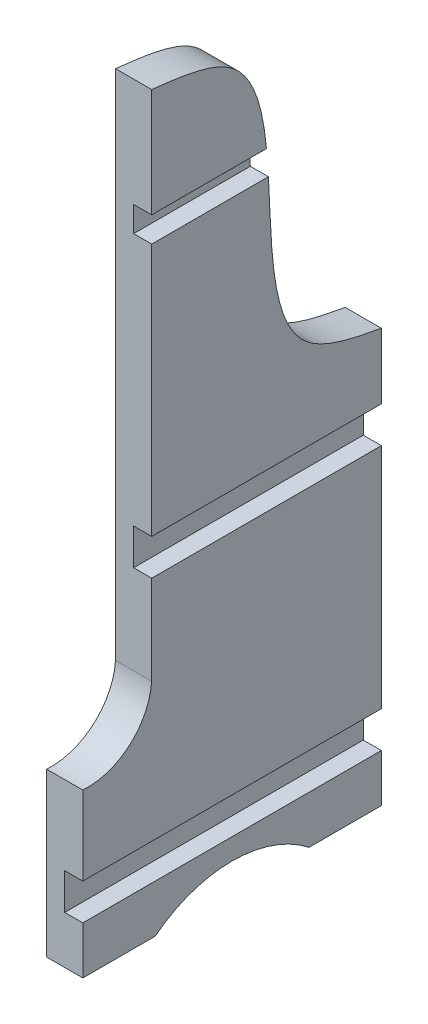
ISO-10303-21;
HEADER;
FILE_DESCRIPTION(('STEP AP214'),'2;1');
FILE_NAME('part.step','',(''),(''),'','','');
FILE_SCHEMA(('AUTOMOTIVE_DESIGN { 1 0 10303 214 1 1 1 1 }'));
ENDSEC;
DATA;
#1=APPLICATION_CONTEXT('core data for automotive mechanical design processes');
#2=APPLICATION_PROTOCOL_DEFINITION('international standard','automotive_design',2000,#1);
#3=PRODUCT_CONTEXT('',#1,'mechanical');
#4=PRODUCT('Part','Part','',(#3));
#5=PRODUCT_RELATED_PRODUCT_CATEGORY('part','',(#4));
#6=PRODUCT_DEFINITION_FORMATION('','',#4);
#7=PRODUCT_DEFINITION_CONTEXT('part definition',#1,'design');
#8=PRODUCT_DEFINITION('design','',#6,#7);
#9=PRODUCT_DEFINITION_SHAPE('','',#8);
#10=(LENGTH_UNIT() NAMED_UNIT(*) SI_UNIT(.MILLI.,.METRE.));
#11=(NAMED_UNIT(*) PLANE_ANGLE_UNIT() SI_UNIT($,.RADIAN.));
#12=(NAMED_UNIT(*) SI_UNIT($,.STERADIAN.) SOLID_ANGLE_UNIT());
#13=UNCERTAINTY_MEASURE_WITH_UNIT(LENGTH_MEASURE(1.E-05),#10,'distance_accuracy_value','');
#14=(GEOMETRIC_REPRESENTATION_CONTEXT(3) GLOBAL_UNCERTAINTY_ASSIGNED_CONTEXT((#13)) GLOBAL_UNIT_ASSIGNED_CONTEXT((#10,
#11,#12)) REPRESENTATION_CONTEXT('',''));
#15=CARTESIAN_POINT('',(0.,0.,0.));
#16=DIRECTION('',(0.,0.,1.));
#17=DIRECTION('',(1.,0.,0.));
#18=AXIS2_PLACEMENT_3D('',#15,#16,#17);
#19=CARTESIAN_POINT('',(10.,62.7739452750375,50.6649001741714));
#20=DIRECTION('',(-1.,0.,0.));
#21=DIRECTION('',(0.,0.,1.));
#22=AXIS2_PLACEMENT_3D('',#19,#20,#21);
#23=PLANE('',#22);
#24=DIRECTION('',(0.,1.,0.));
#25=VECTOR('',#24,1.);
#26=CARTESIAN_POINT('',(10.,0.,-30.6090451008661));
#27=LINE('',#26,#25);
#28=CARTESIAN_POINT('',(10.,0.,-30.6090451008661));
#29=VERTEX_POINT('',#28);
#30=CARTESIAN_POINT('',(10.,13.2,-30.6090451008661));
#31=VERTEX_POINT('',#30);
#32=EDGE_CURVE('E208',#29,#31,#27,.T.);
#33=ORIENTED_EDGE('',*,*,#32,.T.);
#34=DIRECTION('',(0.,0.,1.));
#35=VECTOR('',#34,1.);
#36=CARTESIAN_POINT('',(10.,13.2,50.6649001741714));
#37=LINE('',#36,#35);
#38=CARTESIAN_POINT('',(10.,13.2,51.9409548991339));
#39=VERTEX_POINT('',#38);
#40=EDGE_CURVE('E39',#31,#39,#37,.T.);
#41=ORIENTED_EDGE('',*,*,#40,.T.);
#42=DIRECTION('',(0.,-1.,0.));
#43=VECTOR('',#42,1.);
#44=CARTESIAN_POINT('',(10.,0.,51.9409548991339));
#45=LINE('',#44,#43);
#46=CARTESIAN_POINT('',(10.,0.,51.9409548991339));
#47=VERTEX_POINT('',#46);
#48=EDGE_CURVE('E193',#39,#47,#45,.T.);
#49=ORIENTED_EDGE('',*,*,#48,.T.);
#50=DIRECTION('',(0.,0.,-1.));
#51=VECTOR('',#50,1.);
#52=CARTESIAN_POINT('',(10.,0.,51.9409548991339));
#53=LINE('',#52,#51);
#54=CARTESIAN_POINT('',(10.,0.,31.9409548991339));
#55=VERTEX_POINT('',#54);
#56=EDGE_CURVE('E192',#47,#55,#53,.T.);
#57=ORIENTED_EDGE('',*,*,#56,.T.);
#58=CARTESIAN_POINT('',(10.,-27.0078483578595,10.6659548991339));
#59=DIRECTION('',(-1.,0.,0.));
#60=DIRECTION('',(0.,0.,1.));
#61=AXIS2_PLACEMENT_3D('',#58,#59,#60);
#62=CIRCLE('',#61,34.38094672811);
#63=CARTESIAN_POINT('',(10.,0.,-10.6090451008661));
#64=VERTEX_POINT('',#63);
#65=EDGE_CURVE('E195',#55,#64,#62,.T.);
#66=ORIENTED_EDGE('',*,*,#65,.T.);
#67=DIRECTION('',(0.,0.,-1.));
#68=VECTOR('',#67,1.);
#69=CARTESIAN_POINT('',(10.,0.,-30.6090451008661));
#70=LINE('',#69,#68);
#71=EDGE_CURVE('E205',#64,#29,#70,.T.);
#72=ORIENTED_EDGE('',*,*,#71,.T.);
#73=EDGE_LOOP('',(#33,#41,#49,#57,#66,#72));
#74=FACE_BOUND('',#73,.T.);
#75=ADVANCED_FACE('F31',(#74),#23,.F.);
#76=DIRECTION('',(0.,-1.,0.));
#77=VECTOR('',#76,1.);
#78=CARTESIAN_POINT('',(10.,61.497890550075,32.8909548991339));
#79=LINE('',#78,#77);
#80=CARTESIAN_POINT('',(10.,166.2,32.8909548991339));
#81=VERTEX_POINT('',#80);
#82=CARTESIAN_POINT('',(10.,96.1999999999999,32.8909548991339));
#83=VERTEX_POINT('',#82);
#84=EDGE_CURVE('E284',#81,#83,#79,.T.);
#85=ORIENTED_EDGE('',*,*,#84,.T.);
#86=DIRECTION('',(0.,0.,1.));
#87=VECTOR('',#86,1.);
#88=CARTESIAN_POINT('',(10.,96.1999999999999,33.0756974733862));
#89=LINE('',#88,#87);
#90=CARTESIAN_POINT('',(10.,96.1999999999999,-30.6090451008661));
#91=VERTEX_POINT('',#90);
#92=EDGE_CURVE('E353',#91,#83,#89,.T.);
#93=ORIENTED_EDGE('',*,*,#92,.F.);
#94=CARTESIAN_POINT('',(10.,114.29999733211,-30.6090451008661));
#95=VERTEX_POINT('',#94);
#96=EDGE_CURVE('E207',#91,#95,#27,.T.);
#97=ORIENTED_EDGE('',*,*,#96,.T.);
#98=CARTESIAN_POINT('',(10.,114.29999733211,-30.6090451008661));
#99=CARTESIAN_POINT('',(10.,115.693163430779,-23.1368290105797));
#100=CARTESIAN_POINT('',(10.,122.379582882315,12.7256363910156));
#101=CARTESIAN_POINT('',(10.,198.081436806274,-12.3984097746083));
#102=CARTESIAN_POINT('',(10.,202.284365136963,24.7893608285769));
#103=CARTESIAN_POINT('',(10.,203.2,32.8909548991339));
#104=B_SPLINE_CURVE_WITH_KNOTS('',3,(#98,#99,#100,#101,#102,#103),.UNSPECIFIED.,.F.,.F.,(4,1,1,
4),(0.,0.1707146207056,0.819334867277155,1.),.UNSPECIFIED.);
#105=CARTESIAN_POINT('',(10.,166.2,0.622412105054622));
#106=VERTEX_POINT('',#105);
#107=EDGE_CURVE('E213',#95,#106,#104,.T.);
#108=ORIENTED_EDGE('',*,*,#107,.T.);
#109=DIRECTION('',(0.,0.,1.));
#110=VECTOR('',#109,1.);
#111=CARTESIAN_POINT('',(10.,166.2,50.6649001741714));
#112=LINE('',#111,#110);
#113=EDGE_CURVE('E320',#106,#81,#112,.T.);
#114=ORIENTED_EDGE('',*,*,#113,.T.);
#115=EDGE_LOOP('',(#85,#93,#97,#108,#114));
#116=FACE_BOUND('',#115,.T.);
#117=ADVANCED_FACE('F252',(#116),#23,.F.);
#118=CARTESIAN_POINT('',(10.,203.2,32.8909548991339));
#119=VERTEX_POINT('',#118);
#120=CARTESIAN_POINT('',(10.,173.2,32.8909548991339));
#121=VERTEX_POINT('',#120);
#122=EDGE_CURVE('E220',#119,#121,#79,.T.);
#123=ORIENTED_EDGE('',*,*,#122,.T.);
#124=DIRECTION('',(0.,0.,-1.));
#125=VECTOR('',#124,1.);
#126=CARTESIAN_POINT('',(10.,173.2,50.6649001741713));
#127=LINE('',#126,#125);
#128=CARTESIAN_POINT('',(10.,173.2,1.14688327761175));
#129=VERTEX_POINT('',#128);
#130=EDGE_CURVE('E278',#121,#129,#127,.T.);
#131=ORIENTED_EDGE('',*,*,#130,.T.);
#132=EDGE_CURVE('E211',#129,#119,#104,.T.);
#133=ORIENTED_EDGE('',*,*,#132,.T.);
#134=EDGE_LOOP('',(#123,#131,#133));
#135=FACE_BOUND('',#134,.T.);
#136=ADVANCED_FACE('F250',(#135),#23,.F.);
#137=CARTESIAN_POINT('',(10.,0.,51.9409548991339));
#138=DIRECTION('',(0.,0.,-1.));
#139=DIRECTION('',(-1.,0.,0.));
#140=AXIS2_PLACEMENT_3D('',#137,#138,#139);
#141=PLANE('',#140);
#142=ORIENTED_EDGE('',*,*,#48,.F.);
#143=DIRECTION('',(-1.,0.,0.));
#144=VECTOR('',#143,1.);
#145=CARTESIAN_POINT('',(10.,13.2,51.9409548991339));
#146=LINE('',#145,#144);
#147=CARTESIAN_POINT('',(5.,13.2,51.9409548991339));
#148=VERTEX_POINT('',#147);
#149=EDGE_CURVE('E333',#39,#148,#146,.T.);
#150=ORIENTED_EDGE('',*,*,#149,.T.);
#151=DIRECTION('',(0.,1.,0.));
#152=VECTOR('',#151,1.);
#153=CARTESIAN_POINT('',(5.,0.,51.9409548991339));
#154=LINE('',#153,#152);
#155=CARTESIAN_POINT('',(5.,23.2,51.9409548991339));
#156=VERTEX_POINT('',#155);
#157=EDGE_CURVE('E185',#148,#156,#154,.T.);
#158=ORIENTED_EDGE('',*,*,#157,.T.);
#159=DIRECTION('',(1.,0.,0.));
#160=VECTOR('',#159,1.);
#161=CARTESIAN_POINT('',(10.,23.2,51.9409548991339));
#162=LINE('',#161,#160);
#163=CARTESIAN_POINT('',(10.,23.2,51.9409548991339));
#164=VERTEX_POINT('',#163);
#165=EDGE_CURVE('E171',#156,#164,#162,.T.);
#166=ORIENTED_EDGE('',*,*,#165,.T.);
#167=CARTESIAN_POINT('',(10.,45.,51.9409548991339));
#168=VERTEX_POINT('',#167);
#169=EDGE_CURVE('E183',#168,#164,#45,.T.);
#170=ORIENTED_EDGE('',*,*,#169,.F.);
#171=DIRECTION('',(-1.,0.,0.));
#172=VECTOR('',#171,1.);
#173=CARTESIAN_POINT('',(10.,45.,51.9409548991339));
#174=LINE('',#173,#172);
#175=CARTESIAN_POINT('',(0.,45.,51.9409548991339));
#176=VERTEX_POINT('',#175);
#177=EDGE_CURVE('E285',#168,#176,#174,.T.);
#178=ORIENTED_EDGE('',*,*,#177,.T.);
#179=DIRECTION('',(0.,-1.,0.));
#180=VECTOR('',#179,1.);
#181=CARTESIAN_POINT('',(0.,0.,51.9409548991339));
#182=LINE('',#181,#180);
#183=CARTESIAN_POINT('',(0.,0.,51.9409548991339));
#184=VERTEX_POINT('',#183);
#185=EDGE_CURVE('E334',#176,#184,#182,.T.);
#186=ORIENTED_EDGE('',*,*,#185,.T.);
#187=DIRECTION('',(-1.,0.,0.));
#188=VECTOR('',#187,1.);
#189=CARTESIAN_POINT('',(10.,0.,51.9409548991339));
#190=LINE('',#189,#188);
#191=EDGE_CURVE('E317',#47,#184,#190,.T.);
#192=ORIENTED_EDGE('',*,*,#191,.F.);
#193=EDGE_LOOP('',(#142,#150,#158,#166,#170,#178,#186,#192));
#194=FACE_BOUND('',#193,.T.);
#195=ADVANCED_FACE('F33',(#194),#141,.F.);
#196=CARTESIAN_POINT('',(10.,0.,51.9409548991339));
#197=DIRECTION('',(0.,1.,0.));
#198=DIRECTION('',(0.,0.,1.));
#199=AXIS2_PLACEMENT_3D('',#196,#197,#198);
#200=PLANE('',#199);
#201=DIRECTION('',(0.,0.,-1.));
#202=VECTOR('',#201,1.);
#203=CARTESIAN_POINT('',(0.,0.,51.9409548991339));
#204=LINE('',#203,#202);
#205=CARTESIAN_POINT('',(0.,0.,31.9409548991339));
#206=VERTEX_POINT('',#205);
#207=EDGE_CURVE('E336',#184,#206,#204,.T.);
#208=ORIENTED_EDGE('',*,*,#207,.T.);
#209=DIRECTION('',(-1.,0.,0.));
#210=VECTOR('',#209,1.);
#211=CARTESIAN_POINT('',(10.,0.,31.9409548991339));
#212=LINE('',#211,#210);
#213=EDGE_CURVE('E314',#55,#206,#212,.T.);
#214=ORIENTED_EDGE('',*,*,#213,.F.);
#215=ORIENTED_EDGE('',*,*,#56,.F.);
#216=ORIENTED_EDGE('',*,*,#191,.T.);
#217=EDGE_LOOP('',(#208,#214,#215,#216));
#218=FACE_BOUND('',#217,.T.);
#219=ADVANCED_FACE('F243',(#218),#200,.F.);
#220=CARTESIAN_POINT('',(10.,-27.0078483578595,10.6659548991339));
#221=DIRECTION('',(-1.,0.,0.));
#222=DIRECTION('',(0.,0.,1.));
#223=AXIS2_PLACEMENT_3D('',#220,#221,#222);
#224=CYLINDRICAL_SURFACE('',#223,34.38094672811);
#225=CARTESIAN_POINT('',(0.,-27.0078483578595,10.6659548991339));
#226=DIRECTION('',(-1.,0.,0.));
#227=DIRECTION('',(0.,0.,1.));
#228=AXIS2_PLACEMENT_3D('',#225,#226,#227);
#229=CIRCLE('',#228,34.38094672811);
#230=CARTESIAN_POINT('',(0.,0.,-10.6090451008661));
#231=VERTEX_POINT('',#230);
#232=EDGE_CURVE('E342',#206,#231,#229,.T.);
#233=ORIENTED_EDGE('',*,*,#232,.T.);
#234=DIRECTION('',(-1.,0.,0.));
#235=VECTOR('',#234,1.);
#236=CARTESIAN_POINT('',(10.,0.,-10.6090451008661));
#237=LINE('',#236,#235);
#238=EDGE_CURVE('E311',#64,#231,#237,.T.);
#239=ORIENTED_EDGE('',*,*,#238,.F.);
#240=ORIENTED_EDGE('',*,*,#65,.F.);
#241=ORIENTED_EDGE('',*,*,#213,.T.);
#242=EDGE_LOOP('',(#233,#239,#240,#241));
#243=FACE_BOUND('',#242,.T.);
#244=ADVANCED_FACE('F240',(#243),#224,.F.);
#245=CARTESIAN_POINT('',(10.,0.,-30.6090451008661));
#246=DIRECTION('',(0.,1.,0.));
#247=DIRECTION('',(0.,0.,1.));
#248=AXIS2_PLACEMENT_3D('',#245,#246,#247);
#249=PLANE('',#248);
#250=DIRECTION('',(0.,0.,-1.));
#251=VECTOR('',#250,1.);
#252=CARTESIAN_POINT('',(0.,0.,-30.6090451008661));
#253=LINE('',#252,#251);
#254=CARTESIAN_POINT('',(0.,0.,-30.6090451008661));
#255=VERTEX_POINT('',#254);
#256=EDGE_CURVE('E344',#231,#255,#253,.T.);
#257=ORIENTED_EDGE('',*,*,#256,.T.);
#258=DIRECTION('',(-1.,0.,0.));
#259=VECTOR('',#258,1.);
#260=CARTESIAN_POINT('',(10.,0.,-30.6090451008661));
#261=LINE('',#260,#259);
#262=EDGE_CURVE('E308',#29,#255,#261,.T.);
#263=ORIENTED_EDGE('',*,*,#262,.F.);
#264=ORIENTED_EDGE('',*,*,#71,.F.);
#265=ORIENTED_EDGE('',*,*,#238,.T.);
#266=EDGE_LOOP('',(#257,#263,#264,#265));
#267=FACE_BOUND('',#266,.T.);
#268=ADVANCED_FACE('F236',(#267),#249,.F.);
#269=CARTESIAN_POINT('',(10.,0.,-30.6090451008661));
#270=DIRECTION('',(0.,0.,1.));
#271=DIRECTION('',(1.,0.,0.));
#272=AXIS2_PLACEMENT_3D('',#269,#270,#271);
#273=PLANE('',#272);
#274=DIRECTION('',(0.,-1.,0.));
#275=VECTOR('',#274,1.);
#276=CARTESIAN_POINT('',(5.,0.,-30.6090451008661));
#277=LINE('',#276,#275);
#278=CARTESIAN_POINT('',(5.,23.2,-30.6090451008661));
#279=VERTEX_POINT('',#278);
#280=CARTESIAN_POINT('',(5.,13.2,-30.6090451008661));
#281=VERTEX_POINT('',#280);
#282=EDGE_CURVE('E11',#279,#281,#277,.T.);
#283=ORIENTED_EDGE('',*,*,#282,.T.);
#284=DIRECTION('',(1.,0.,0.));
#285=VECTOR('',#284,1.);
#286=CARTESIAN_POINT('',(10.,13.2,-30.6090451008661));
#287=LINE('',#286,#285);
#288=EDGE_CURVE('E186',#281,#31,#287,.T.);
#289=ORIENTED_EDGE('',*,*,#288,.T.);
#290=ORIENTED_EDGE('',*,*,#32,.F.);
#291=ORIENTED_EDGE('',*,*,#262,.T.);
#292=DIRECTION('',(0.,1.,0.));
#293=VECTOR('',#292,1.);
#294=CARTESIAN_POINT('',(0.,0.,-30.6090451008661));
#295=LINE('',#294,#293);
#296=CARTESIAN_POINT('',(0.,114.29999733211,-30.6090451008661));
#297=VERTEX_POINT('',#296);
#298=EDGE_CURVE('E393',#255,#297,#295,.T.);
#299=ORIENTED_EDGE('',*,*,#298,.T.);
#300=DIRECTION('',(-1.,0.,0.));
#301=VECTOR('',#300,1.);
#302=CARTESIAN_POINT('',(10.,114.29999733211,-30.6090451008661));
#303=LINE('',#302,#301);
#304=EDGE_CURVE('E305',#95,#297,#303,.T.);
#305=ORIENTED_EDGE('',*,*,#304,.F.);
#306=ORIENTED_EDGE('',*,*,#96,.F.);
#307=DIRECTION('',(1.,0.,0.));
#308=VECTOR('',#307,1.);
#309=CARTESIAN_POINT('',(5.,96.1999999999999,-30.6090451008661));
#310=LINE('',#309,#308);
#311=CARTESIAN_POINT('',(5.,96.1999999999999,-30.6090451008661));
#312=VERTEX_POINT('',#311);
#313=EDGE_CURVE('E363',#312,#91,#310,.T.);
#314=ORIENTED_EDGE('',*,*,#313,.F.);
#315=DIRECTION('',(0.,1.,0.));
#316=VECTOR('',#315,1.);
#317=CARTESIAN_POINT('',(5.,96.1999999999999,-30.6090451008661));
#318=LINE('',#317,#316);
#319=CARTESIAN_POINT('',(5.,86.2,-30.6090451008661));
#320=VERTEX_POINT('',#319);
#321=EDGE_CURVE('E356',#320,#312,#318,.T.);
#322=ORIENTED_EDGE('',*,*,#321,.F.);
#323=DIRECTION('',(1.,0.,0.));
#324=VECTOR('',#323,1.);
#325=CARTESIAN_POINT('',(5.,86.2,-30.6090451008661));
#326=LINE('',#325,#324);
#327=CARTESIAN_POINT('',(10.,86.2,-30.6090451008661));
#328=VERTEX_POINT('',#327);
#329=EDGE_CURVE('E361',#320,#328,#326,.T.);
#330=ORIENTED_EDGE('',*,*,#329,.T.);
#331=CARTESIAN_POINT('',(10.,23.2,-30.6090451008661));
#332=VERTEX_POINT('',#331);
#333=EDGE_CURVE('E212',#332,#328,#27,.T.);
#334=ORIENTED_EDGE('',*,*,#333,.F.);
#335=DIRECTION('',(-1.,0.,0.));
#336=VECTOR('',#335,1.);
#337=CARTESIAN_POINT('',(10.,23.2,-30.6090451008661));
#338=LINE('',#337,#336);
#339=EDGE_CURVE('E46',#332,#279,#338,.T.);
#340=ORIENTED_EDGE('',*,*,#339,.T.);
#341=EDGE_LOOP('',(#283,#289,#290,#291,#299,#305,#306,#314,#322,#330,#334,#340));
#342=FACE_BOUND('',#341,.T.);
#343=ADVANCED_FACE('F231',(#342),#273,.F.);
#344=DIRECTION('',(-1.,0.,0.));
#345=VECTOR('',#344,1.);
#346=SURFACE_OF_LINEAR_EXTRUSION('',#104,#345);
#347=ORIENTED_EDGE('',*,*,#132,.F.);
#348=DIRECTION('',(-1.,0.,0.));
#349=VECTOR('',#348,1.);
#350=CARTESIAN_POINT('',(10.,173.2,1.14688327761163));
#351=LINE('',#350,#349);
#352=CARTESIAN_POINT('',(5.,173.2,1.14688327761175));
#353=VERTEX_POINT('',#352);
#354=EDGE_CURVE('E383',#129,#353,#351,.T.);
#355=ORIENTED_EDGE('',*,*,#354,.T.);
#356=CARTESIAN_POINT('',(5.,114.29999733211,-30.6090451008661));
#357=CARTESIAN_POINT('',(5.,115.693163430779,-23.1368290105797));
#358=CARTESIAN_POINT('',(5.,122.379582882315,12.7256363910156));
#359=CARTESIAN_POINT('',(5.,198.081436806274,-12.3984097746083));
#360=CARTESIAN_POINT('',(5.,202.284365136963,24.7893608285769));
#361=CARTESIAN_POINT('',(5.,203.2,32.8909548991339));
#362=B_SPLINE_CURVE_WITH_KNOTS('',3,(#356,#357,#358,#359,#360,#361),.UNSPECIFIED.,.F.,.F.,(4,1,
1,4),(0.,0.1707146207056,0.819334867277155,1.),.UNSPECIFIED.);
#363=CARTESIAN_POINT('',(5.,166.2,0.622412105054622));
#364=VERTEX_POINT('',#363);
#365=EDGE_CURVE('E199',#364,#353,#362,.T.);
#366=ORIENTED_EDGE('',*,*,#365,.F.);
#367=DIRECTION('',(1.,0.,0.));
#368=VECTOR('',#367,1.);
#369=CARTESIAN_POINT('',(5.,166.2,0.622412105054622));
#370=LINE('',#369,#368);
#371=EDGE_CURVE('E376',#364,#106,#370,.T.);
#372=ORIENTED_EDGE('',*,*,#371,.T.);
#373=ORIENTED_EDGE('',*,*,#107,.F.);
#374=ORIENTED_EDGE('',*,*,#304,.T.);
#375=CARTESIAN_POINT('',(0.,114.29999733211,-30.6090451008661));
#376=CARTESIAN_POINT('',(0.,115.693163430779,-23.1368290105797));
#377=CARTESIAN_POINT('',(0.,122.379582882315,12.7256363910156));
#378=CARTESIAN_POINT('',(0.,198.081436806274,-12.3984097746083));
#379=CARTESIAN_POINT('',(0.,202.284365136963,24.7893608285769));
#380=CARTESIAN_POINT('',(0.,203.2,32.8909548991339));
#381=B_SPLINE_CURVE_WITH_KNOTS('',3,(#375,#376,#377,#378,#379,#380),.UNSPECIFIED.,.F.,.F.,(4,1,
1,4),(0.,0.1707146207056,0.819334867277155,1.),.UNSPECIFIED.);
#382=CARTESIAN_POINT('',(0.,203.2,32.8909548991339));
#383=VERTEX_POINT('',#382);
#384=EDGE_CURVE('E395',#297,#383,#381,.T.);
#385=ORIENTED_EDGE('',*,*,#384,.T.);
#386=DIRECTION('',(-1.,0.,0.));
#387=VECTOR('',#386,1.);
#388=CARTESIAN_POINT('',(10.,203.2,32.8909548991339));
#389=LINE('',#388,#387);
#390=EDGE_CURVE('E296',#119,#383,#389,.T.);
#391=ORIENTED_EDGE('',*,*,#390,.F.);
#392=EDGE_LOOP('',(#347,#355,#366,#372,#373,#374,#385,#391));
#393=FACE_BOUND('',#392,.T.);
#394=ADVANCED_FACE('F226',(#393),#346,.F.);
#395=CARTESIAN_POINT('',(10.,61.497890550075,32.8909548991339));
#396=DIRECTION('',(0.,0.,-1.));
#397=DIRECTION('',(-1.,0.,0.));
#398=AXIS2_PLACEMENT_3D('',#395,#396,#397);
#399=PLANE('',#398);
#400=DIRECTION('',(0.,-1.,0.));
#401=VECTOR('',#400,1.);
#402=CARTESIAN_POINT('',(5.,61.497890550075,32.8909548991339));
#403=LINE('',#402,#401);
#404=CARTESIAN_POINT('',(5.,96.1999999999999,32.8909548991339));
#405=VERTEX_POINT('',#404);
#406=CARTESIAN_POINT('',(5.,86.2,32.8909548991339));
#407=VERTEX_POINT('',#406);
#408=EDGE_CURVE('E176',#405,#407,#403,.T.);
#409=ORIENTED_EDGE('',*,*,#408,.F.);
#410=DIRECTION('',(1.,0.,0.));
#411=VECTOR('',#410,1.);
#412=CARTESIAN_POINT('',(10.,96.1999999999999,32.8909548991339));
#413=LINE('',#412,#411);
#414=EDGE_CURVE('E368',#405,#83,#413,.T.);
#415=ORIENTED_EDGE('',*,*,#414,.T.);
#416=ORIENTED_EDGE('',*,*,#84,.F.);
#417=DIRECTION('',(-1.,0.,0.));
#418=VECTOR('',#417,1.);
#419=CARTESIAN_POINT('',(10.,166.2,32.8909548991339));
#420=LINE('',#419,#418);
#421=CARTESIAN_POINT('',(5.,166.2,32.8909548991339));
#422=VERTEX_POINT('',#421);
#423=EDGE_CURVE('E379',#81,#422,#420,.T.);
#424=ORIENTED_EDGE('',*,*,#423,.T.);
#425=DIRECTION('',(0.,-1.,0.));
#426=VECTOR('',#425,1.);
#427=CARTESIAN_POINT('',(5.,61.497890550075,32.8909548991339));
#428=LINE('',#427,#426);
#429=CARTESIAN_POINT('',(5.,173.2,32.8909548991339));
#430=VERTEX_POINT('',#429);
#431=EDGE_CURVE('E324',#430,#422,#428,.T.);
#432=ORIENTED_EDGE('',*,*,#431,.F.);
#433=DIRECTION('',(1.,0.,0.));
#434=VECTOR('',#433,1.);
#435=CARTESIAN_POINT('',(10.,173.2,32.8909548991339));
#436=LINE('',#435,#434);
#437=EDGE_CURVE('E382',#430,#121,#436,.T.);
#438=ORIENTED_EDGE('',*,*,#437,.T.);
#439=ORIENTED_EDGE('',*,*,#122,.F.);
#440=ORIENTED_EDGE('',*,*,#390,.T.);
#441=DIRECTION('',(0.,-1.,0.));
#442=VECTOR('',#441,1.);
#443=CARTESIAN_POINT('',(0.,61.497890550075,32.8909548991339));
#444=LINE('',#443,#442);
#445=CARTESIAN_POINT('',(0.,61.497890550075,32.8909548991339));
#446=VERTEX_POINT('',#445);
#447=EDGE_CURVE('E294',#383,#446,#444,.T.);
#448=ORIENTED_EDGE('',*,*,#447,.T.);
#449=DIRECTION('',(-1.,0.,0.));
#450=VECTOR('',#449,1.);
#451=CARTESIAN_POINT('',(10.,61.497890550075,32.8909548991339));
#452=LINE('',#451,#450);
#453=CARTESIAN_POINT('',(10.,61.497890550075,32.8909548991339));
#454=VERTEX_POINT('',#453);
#455=EDGE_CURVE('E291',#454,#446,#452,.T.);
#456=ORIENTED_EDGE('',*,*,#455,.F.);
#457=CARTESIAN_POINT('',(10.,86.2,32.8909548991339));
#458=VERTEX_POINT('',#457);
#459=EDGE_CURVE('E219',#458,#454,#79,.T.);
#460=ORIENTED_EDGE('',*,*,#459,.F.);
#461=DIRECTION('',(-1.,0.,0.));
#462=VECTOR('',#461,1.);
#463=CARTESIAN_POINT('',(10.,86.2,32.8909548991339));
#464=LINE('',#463,#462);
#465=EDGE_CURVE('E54',#458,#407,#464,.T.);
#466=ORIENTED_EDGE('',*,*,#465,.T.);
#467=EDGE_LOOP('',(#409,#415,#416,#424,#432,#438,#439,#440,#448,#456,#460,#466));
#468=FACE_BOUND('',#467,.T.);
#469=ADVANCED_FACE('F230',(#468),#399,.F.);
#470=CARTESIAN_POINT('',(10.,62.7739452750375,50.6649001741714));
#471=DIRECTION('',(-1.,0.,0.));
#472=DIRECTION('',(0.,0.,1.));
#473=AXIS2_PLACEMENT_3D('',#470,#471,#472);
#474=CYLINDRICAL_SURFACE('',#473,17.819692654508);
#475=CARTESIAN_POINT('',(0.,62.7739452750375,50.6649001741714));
#476=DIRECTION('',(-1.,0.,0.));
#477=DIRECTION('',(0.,0.,1.));
#478=AXIS2_PLACEMENT_3D('',#475,#476,#477);
#479=CIRCLE('',#478,17.819692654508);
#480=EDGE_CURVE('E197',#446,#176,#479,.T.);
#481=ORIENTED_EDGE('',*,*,#480,.T.);
#482=ORIENTED_EDGE('',*,*,#177,.F.);
#483=CARTESIAN_POINT('',(10.,62.7739452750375,50.6649001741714));
#484=DIRECTION('',(-1.,0.,0.));
#485=DIRECTION('',(0.,0.,1.));
#486=AXIS2_PLACEMENT_3D('',#483,#484,#485);
#487=CIRCLE('',#486,17.819692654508);
#488=EDGE_CURVE('E190',#454,#168,#487,.T.);
#489=ORIENTED_EDGE('',*,*,#488,.F.);
#490=ORIENTED_EDGE('',*,*,#455,.T.);
#491=EDGE_LOOP('',(#481,#482,#489,#490));
#492=FACE_BOUND('',#491,.T.);
#493=ADVANCED_FACE('F263',(#492),#474,.F.);
#494=ORIENTED_EDGE('',*,*,#169,.T.);
#495=DIRECTION('',(0.,0.,-1.));
#496=VECTOR('',#495,1.);
#497=CARTESIAN_POINT('',(10.,23.2,50.6649001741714));
#498=LINE('',#497,#496);
#499=EDGE_CURVE('E168',#164,#332,#498,.T.);
#500=ORIENTED_EDGE('',*,*,#499,.T.);
#501=ORIENTED_EDGE('',*,*,#333,.T.);
#502=DIRECTION('',(0.,0.,1.));
#503=VECTOR('',#502,1.);
#504=CARTESIAN_POINT('',(10.,86.2,50.6649001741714));
#505=LINE('',#504,#503);
#506=EDGE_CURVE('E289',#328,#458,#505,.T.);
#507=ORIENTED_EDGE('',*,*,#506,.T.);
#508=ORIENTED_EDGE('',*,*,#459,.T.);
#509=ORIENTED_EDGE('',*,*,#488,.T.);
#510=EDGE_LOOP('',(#494,#500,#501,#507,#508,#509));
#511=FACE_BOUND('',#510,.T.);
#512=ADVANCED_FACE('F188',(#511),#23,.F.);
#513=CARTESIAN_POINT('',(0.,62.7739452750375,50.6649001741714));
#514=DIRECTION('',(-1.,0.,0.));
#515=DIRECTION('',(0.,0.,1.));
#516=AXIS2_PLACEMENT_3D('',#513,#514,#515);
#517=PLANE('',#516);
#518=ORIENTED_EDGE('',*,*,#185,.F.);
#519=ORIENTED_EDGE('',*,*,#480,.F.);
#520=ORIENTED_EDGE('',*,*,#447,.F.);
#521=ORIENTED_EDGE('',*,*,#384,.F.);
#522=ORIENTED_EDGE('',*,*,#298,.F.);
#523=ORIENTED_EDGE('',*,*,#256,.F.);
#524=ORIENTED_EDGE('',*,*,#232,.F.);
#525=ORIENTED_EDGE('',*,*,#207,.F.);
#526=EDGE_LOOP('',(#518,#519,#520,#521,#522,#523,#524,#525));
#527=FACE_BOUND('',#526,.T.);
#528=ADVANCED_FACE('F262',(#527),#517,.T.);
#529=CARTESIAN_POINT('',(5.,166.2,33.4050374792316));
#530=DIRECTION('',(1.,0.,0.));
#531=DIRECTION('',(0.,0.,-1.));
#532=AXIS2_PLACEMENT_3D('',#529,#530,#531);
#533=PLANE('',#532);
#534=ORIENTED_EDGE('',*,*,#365,.T.);
#535=DIRECTION('',(0.,0.,1.));
#536=VECTOR('',#535,1.);
#537=CARTESIAN_POINT('',(5.,173.2,33.4050374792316));
#538=LINE('',#537,#536);
#539=EDGE_CURVE('E373',#353,#430,#538,.T.);
#540=ORIENTED_EDGE('',*,*,#539,.T.);
#541=ORIENTED_EDGE('',*,*,#431,.T.);
#542=DIRECTION('',(0.,0.,-1.));
#543=VECTOR('',#542,1.);
#544=CARTESIAN_POINT('',(5.,166.2,33.4050374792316));
#545=LINE('',#544,#543);
#546=EDGE_CURVE('E371',#422,#364,#545,.T.);
#547=ORIENTED_EDGE('',*,*,#546,.T.);
#548=EDGE_LOOP('',(#534,#540,#541,#547));
#549=FACE_BOUND('',#548,.T.);
#550=ADVANCED_FACE('F268',(#549),#533,.T.);
#551=CARTESIAN_POINT('',(5.,173.2,33.4050374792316));
#552=DIRECTION('',(0.,1.,0.));
#553=DIRECTION('',(0.,0.,1.));
#554=AXIS2_PLACEMENT_3D('',#551,#552,#553);
#555=PLANE('',#554);
#556=ORIENTED_EDGE('',*,*,#130,.F.);
#557=ORIENTED_EDGE('',*,*,#437,.F.);
#558=ORIENTED_EDGE('',*,*,#539,.F.);
#559=ORIENTED_EDGE('',*,*,#354,.F.);
#560=EDGE_LOOP('',(#556,#557,#558,#559));
#561=FACE_BOUND('',#560,.T.);
#562=ADVANCED_FACE('F422',(#561),#555,.F.);
#563=CARTESIAN_POINT('',(5.,166.2,33.4050374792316));
#564=DIRECTION('',(0.,-1.,0.));
#565=DIRECTION('',(0.,0.,-1.));
#566=AXIS2_PLACEMENT_3D('',#563,#564,#565);
#567=PLANE('',#566);
#568=ORIENTED_EDGE('',*,*,#113,.F.);
#569=ORIENTED_EDGE('',*,*,#371,.F.);
#570=ORIENTED_EDGE('',*,*,#546,.F.);
#571=ORIENTED_EDGE('',*,*,#423,.F.);
#572=EDGE_LOOP('',(#568,#569,#570,#571));
#573=FACE_BOUND('',#572,.T.);
#574=ADVANCED_FACE('F420',(#573),#567,.F.);
#575=CARTESIAN_POINT('',(5.,86.2,33.0756974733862));
#576=DIRECTION('',(1.,0.,0.));
#577=DIRECTION('',(0.,0.,-1.));
#578=AXIS2_PLACEMENT_3D('',#575,#576,#577);
#579=PLANE('',#578);
#580=ORIENTED_EDGE('',*,*,#408,.T.);
#581=DIRECTION('',(0.,0.,-1.));
#582=VECTOR('',#581,1.);
#583=CARTESIAN_POINT('',(5.,86.2,33.0756974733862));
#584=LINE('',#583,#582);
#585=EDGE_CURVE('E354',#407,#320,#584,.T.);
#586=ORIENTED_EDGE('',*,*,#585,.T.);
#587=ORIENTED_EDGE('',*,*,#321,.T.);
#588=DIRECTION('',(0.,0.,1.));
#589=VECTOR('',#588,1.);
#590=CARTESIAN_POINT('',(5.,96.1999999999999,33.0756974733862));
#591=LINE('',#590,#589);
#592=EDGE_CURVE('E358',#312,#405,#591,.T.);
#593=ORIENTED_EDGE('',*,*,#592,.T.);
#594=EDGE_LOOP('',(#580,#586,#587,#593));
#595=FACE_BOUND('',#594,.T.);
#596=ADVANCED_FACE('F414',(#595),#579,.T.);
#597=CARTESIAN_POINT('',(5.,96.1999999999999,33.0756974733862));
#598=DIRECTION('',(0.,1.,0.));
#599=DIRECTION('',(0.,0.,1.));
#600=AXIS2_PLACEMENT_3D('',#597,#598,#599);
#601=PLANE('',#600);
#602=ORIENTED_EDGE('',*,*,#592,.F.);
#603=ORIENTED_EDGE('',*,*,#313,.T.);
#604=ORIENTED_EDGE('',*,*,#92,.T.);
#605=ORIENTED_EDGE('',*,*,#414,.F.);
#606=EDGE_LOOP('',(#602,#603,#604,#605));
#607=FACE_BOUND('',#606,.T.);
#608=ADVANCED_FACE('F416',(#607),#601,.F.);
#609=CARTESIAN_POINT('',(5.,86.2,33.0756974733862));
#610=DIRECTION('',(0.,-1.,0.));
#611=DIRECTION('',(0.,0.,-1.));
#612=AXIS2_PLACEMENT_3D('',#609,#610,#611);
#613=PLANE('',#612);
#614=ORIENTED_EDGE('',*,*,#506,.F.);
#615=ORIENTED_EDGE('',*,*,#329,.F.);
#616=ORIENTED_EDGE('',*,*,#585,.F.);
#617=ORIENTED_EDGE('',*,*,#465,.F.);
#618=EDGE_LOOP('',(#614,#615,#616,#617));
#619=FACE_BOUND('',#618,.T.);
#620=ADVANCED_FACE('F410',(#619),#613,.F.);
#621=CARTESIAN_POINT('',(5.,13.2,-30.9140279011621));
#622=DIRECTION('',(-1.,0.,0.));
#623=DIRECTION('',(0.,0.,1.));
#624=AXIS2_PLACEMENT_3D('',#621,#622,#623);
#625=PLANE('',#624);
#626=DIRECTION('',(0.,0.,-1.));
#627=VECTOR('',#626,1.);
#628=CARTESIAN_POINT('',(5.,13.2,-30.9140279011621));
#629=LINE('',#628,#627);
#630=EDGE_CURVE('E447',#148,#281,#629,.T.);
#631=ORIENTED_EDGE('',*,*,#630,.T.);
#632=ORIENTED_EDGE('',*,*,#282,.F.);
#633=DIRECTION('',(0.,0.,1.));
#634=VECTOR('',#633,1.);
#635=CARTESIAN_POINT('',(5.,23.2,-30.9140279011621));
#636=LINE('',#635,#634);
#637=EDGE_CURVE('E448',#279,#156,#636,.T.);
#638=ORIENTED_EDGE('',*,*,#637,.T.);
#639=ORIENTED_EDGE('',*,*,#157,.F.);
#640=EDGE_LOOP('',(#631,#632,#638,#639));
#641=FACE_BOUND('',#640,.T.);
#642=ADVANCED_FACE('F433',(#641),#625,.F.);
#643=CARTESIAN_POINT('',(5.,13.2,-30.9140279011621));
#644=DIRECTION('',(0.,-1.,0.));
#645=DIRECTION('',(0.,0.,-1.));
#646=AXIS2_PLACEMENT_3D('',#643,#644,#645);
#647=PLANE('',#646);
#648=ORIENTED_EDGE('',*,*,#40,.F.);
#649=ORIENTED_EDGE('',*,*,#288,.F.);
#650=ORIENTED_EDGE('',*,*,#630,.F.);
#651=ORIENTED_EDGE('',*,*,#149,.F.);
#652=EDGE_LOOP('',(#648,#649,#650,#651));
#653=FACE_BOUND('',#652,.T.);
#654=ADVANCED_FACE('F440',(#653),#647,.F.);
#655=CARTESIAN_POINT('',(5.,23.2,-30.9140279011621));
#656=DIRECTION('',(0.,1.,0.));
#657=DIRECTION('',(0.,0.,1.));
#658=AXIS2_PLACEMENT_3D('',#655,#656,#657);
#659=PLANE('',#658);
#660=ORIENTED_EDGE('',*,*,#637,.F.);
#661=ORIENTED_EDGE('',*,*,#339,.F.);
#662=ORIENTED_EDGE('',*,*,#499,.F.);
#663=ORIENTED_EDGE('',*,*,#165,.F.);
#664=EDGE_LOOP('',(#660,#661,#662,#663));
#665=FACE_BOUND('',#664,.T.);
#666=ADVANCED_FACE('F170',(#665),#659,.F.);
#667=CLOSED_SHELL('',(#75,#117,#136,#195,#219,#244,#268,#343,#394,#469,#493,#512,#528,#550,#562,
#574,#596,#608,#620,#642,#654,#666));
#668=MANIFOLD_SOLID_BREP('B2',#667);
#669=ADVANCED_BREP_SHAPE_REPRESENTATION('',(#18,#668),#14);
#670=SHAPE_DEFINITION_REPRESENTATION(#9,#669);
ENDSEC;
END-ISO-10303-21;
